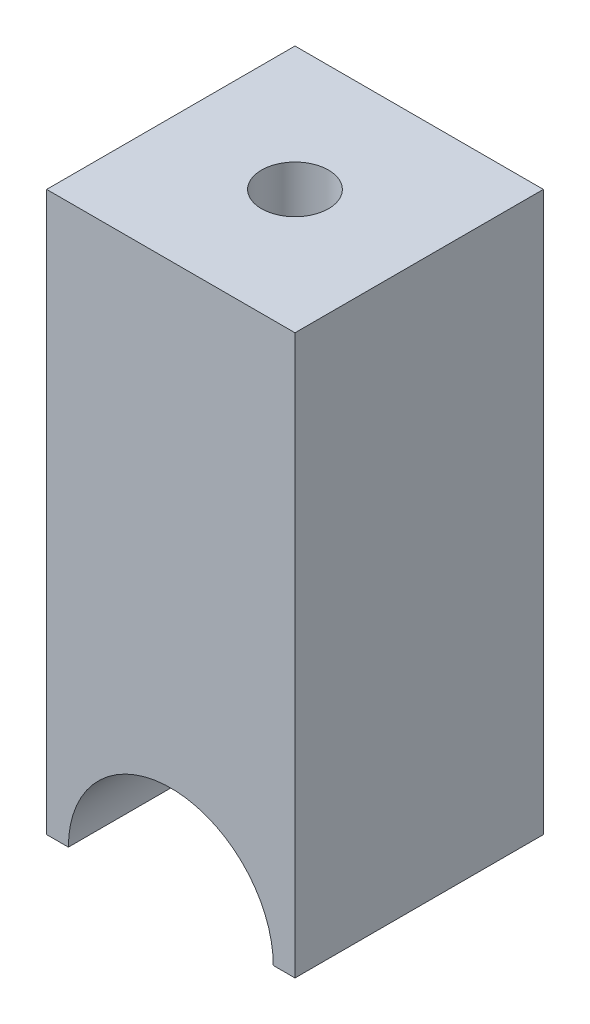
from build123d import *

# Parameters (mm, degrees)
SKETCH1_W          = 25.4
SKETCH1_H          = 25.4
EXTRUDE1_DEPTH     = 57.15
SKETCH2_R          = 10.4775
CUT_EXTRUDE1_DEPTH = 64.816710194
SKETCH3_R          = 3.429
CUT_EXTRUDE2_DEPTH = 60.905780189


with BuildPart() as part:
    # Sketch1 → Extrude1 (new body)
    with BuildSketch(Plane(origin=(0, 0, 0), x_dir=(1, 0, 0), z_dir=(0, 1, 0))):
        Rectangle(SKETCH1_W, SKETCH1_H)
    extrude(amount=EXTRUDE1_DEPTH)

    # Sketch2 → Cut-Extrude1 (cut, through all)
    with BuildSketch(Plane.XY.offset(12.7)):
        Circle(SKETCH2_R)
    extrude(amount=-CUT_EXTRUDE1_DEPTH, mode=Mode.SUBTRACT)

    # Sketch3 → Cut-Extrude2 (cut, through all)
    with BuildSketch(Plane(origin=(0, 57.15, 0), x_dir=(-1, 0, 0), z_dir=(0, 1, 0))):
        with Locations(Location((0, 0, 0), (0, 0, 90))):
            Circle(SKETCH3_R)
    extrude(amount=-CUT_EXTRUDE2_DEPTH, mode=Mode.SUBTRACT)


solid = part.part
